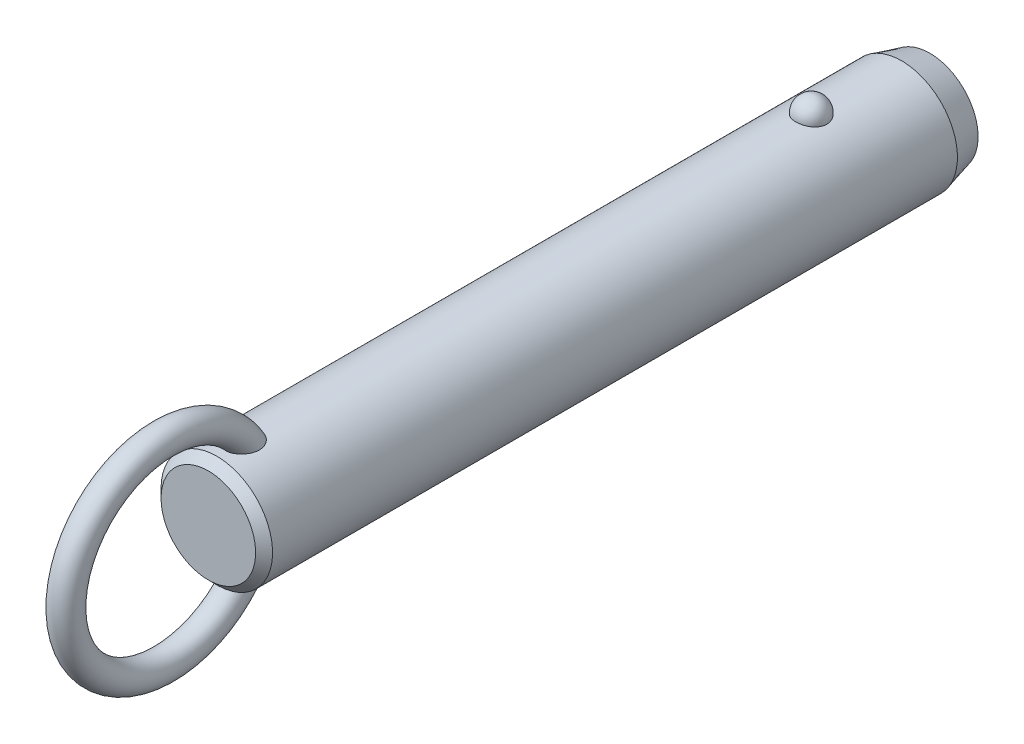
ISO-10303-21;
HEADER;
FILE_DESCRIPTION(('STEP AP214'),'2;1');
FILE_NAME('part.step','',(''),(''),'','','');
FILE_SCHEMA(('AUTOMOTIVE_DESIGN { 1 0 10303 214 1 1 1 1 }'));
ENDSEC;
DATA;
#1=APPLICATION_CONTEXT('core data for automotive mechanical design processes');
#2=APPLICATION_PROTOCOL_DEFINITION('international standard','automotive_design',2000,#1);
#3=PRODUCT_CONTEXT('',#1,'mechanical');
#4=PRODUCT('Part','Part','',(#3));
#5=PRODUCT_RELATED_PRODUCT_CATEGORY('part','',(#4));
#6=PRODUCT_DEFINITION_FORMATION('','',#4);
#7=PRODUCT_DEFINITION_CONTEXT('part definition',#1,'design');
#8=PRODUCT_DEFINITION('design','',#6,#7);
#9=PRODUCT_DEFINITION_SHAPE('','',#8);
#10=(LENGTH_UNIT() NAMED_UNIT(*) SI_UNIT(.MILLI.,.METRE.));
#11=(NAMED_UNIT(*) PLANE_ANGLE_UNIT() SI_UNIT($,.RADIAN.));
#12=(NAMED_UNIT(*) SI_UNIT($,.STERADIAN.) SOLID_ANGLE_UNIT());
#13=UNCERTAINTY_MEASURE_WITH_UNIT(LENGTH_MEASURE(1.E-05),#10,'distance_accuracy_value','');
#14=(GEOMETRIC_REPRESENTATION_CONTEXT(3) GLOBAL_UNCERTAINTY_ASSIGNED_CONTEXT((#13)) GLOBAL_UNIT_ASSIGNED_CONTEXT((#10,
#11,#12)) REPRESENTATION_CONTEXT('',''));
#15=CARTESIAN_POINT('',(0.,0.,0.));
#16=DIRECTION('',(0.,0.,1.));
#17=DIRECTION('',(1.,0.,0.));
#18=AXIS2_PLACEMENT_3D('',#15,#16,#17);
#19=CARTESIAN_POINT('',(0.,0.,73.7));
#20=DIRECTION('',(0.,0.,-1.));
#21=DIRECTION('',(-1.,0.,0.));
#22=AXIS2_PLACEMENT_3D('',#19,#20,#21);
#23=CYLINDRICAL_SURFACE('',#22,7.9);
#24=CARTESIAN_POINT('',(2.1785689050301,7.59367088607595,-2.19999999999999));
#25=CARTESIAN_POINT('',(2.17856679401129,7.59367269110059,-2.07701843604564));
#26=CARTESIAN_POINT('',(2.16853481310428,7.59657145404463,-1.95401006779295));
#27=CARTESIAN_POINT('',(2.12864689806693,7.607843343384,-1.71147811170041));
#28=CARTESIAN_POINT('',(2.09878338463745,7.61621856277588,-1.59195587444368));
#29=CARTESIAN_POINT('',(2.0199931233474,7.63749180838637,-1.3598563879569));
#30=CARTESIAN_POINT('',(1.97107475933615,7.6503878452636,-1.24727610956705));
#31=CARTESIAN_POINT('',(1.85539377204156,7.67926115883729,-1.03213234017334));
#32=CARTESIAN_POINT('',(1.78863158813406,7.69523835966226,-0.929568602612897));
#33=CARTESIAN_POINT('',(1.63856494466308,7.7285848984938,-0.736786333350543));
#34=CARTESIAN_POINT('',(1.55518140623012,7.7459606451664,-0.646630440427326));
#35=CARTESIAN_POINT('',(1.37422937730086,7.78009978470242,-0.481747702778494));
#36=CARTESIAN_POINT('',(1.27666086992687,7.79686317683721,-0.407020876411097));
#37=CARTESIAN_POINT('',(1.07024728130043,7.82786153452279,-0.275278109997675));
#38=CARTESIAN_POINT('',(0.961434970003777,7.84210353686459,-0.218212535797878));
#39=CARTESIAN_POINT('',(0.735351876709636,7.86652194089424,-0.123146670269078));
#40=CARTESIAN_POINT('',(0.618082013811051,7.87669878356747,-0.085144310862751));
#41=CARTESIAN_POINT('',(0.380637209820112,7.89170521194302,-0.0298158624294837));
#42=CARTESIAN_POINT('',(0.260550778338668,7.89662650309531,-0.0121347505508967));
#43=CARTESIAN_POINT('',(0.0190117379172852,7.90090003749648,0.00324379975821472));
#44=CARTESIAN_POINT('',(-0.102440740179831,7.90025280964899,0.00094313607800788));
#45=CARTESIAN_POINT('',(-0.341452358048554,7.89351056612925,-0.0233955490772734));
#46=CARTESIAN_POINT('',(-0.459042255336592,7.88749257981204,-0.0451545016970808));
#47=CARTESIAN_POINT('',(-0.688796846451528,7.87075812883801,-0.107408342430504));
#48=CARTESIAN_POINT('',(-0.800961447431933,7.86004158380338,-0.147903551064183));
#49=CARTESIAN_POINT('',(-1.01743634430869,7.83497131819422,-0.246799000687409));
#50=CARTESIAN_POINT('',(-1.12169791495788,7.82059709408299,-0.305300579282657));
#51=CARTESIAN_POINT('',(-1.31891765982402,7.78976470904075,-0.438549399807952));
#52=CARTESIAN_POINT('',(-1.41187469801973,7.77330633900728,-0.513298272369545));
#53=CARTESIAN_POINT('',(-1.58577142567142,7.73972434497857,-0.678622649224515));
#54=CARTESIAN_POINT('',(-1.66645140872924,7.72259402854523,-0.769470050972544));
#55=CARTESIAN_POINT('',(-1.81161503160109,7.68983776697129,-0.963538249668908));
#56=CARTESIAN_POINT('',(-1.87609753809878,7.6742119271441,-1.06675991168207));
#57=CARTESIAN_POINT('',(-1.98790138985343,7.6460202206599,-1.28401170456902));
#58=CARTESIAN_POINT('',(-2.03501994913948,7.63349104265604,-1.39815107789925));
#59=CARTESIAN_POINT('',(-2.10986724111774,7.6131449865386,-1.63301784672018));
#60=CARTESIAN_POINT('',(-2.1375965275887,7.60532797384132,-1.75374505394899));
#61=CARTESIAN_POINT('',(-2.17289256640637,7.5953195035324,-1.99782562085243));
#62=CARTESIAN_POINT('',(-2.18054294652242,7.59310471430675,-2.12116592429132));
#63=CARTESIAN_POINT('',(-2.17572919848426,7.59448538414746,-2.36741799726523));
#64=CARTESIAN_POINT('',(-2.1632656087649,7.59808068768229,-2.49032977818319));
#65=CARTESIAN_POINT('',(-2.11865035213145,7.61064035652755,-2.73161015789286));
#66=CARTESIAN_POINT('',(-2.08659579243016,7.61957823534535,-2.84999812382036));
#67=CARTESIAN_POINT('',(-2.00367799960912,7.64179982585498,-3.07955956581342));
#68=CARTESIAN_POINT('',(-1.9528140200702,7.65508371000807,-3.19073275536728));
#69=CARTESIAN_POINT('',(-1.83321113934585,7.68460381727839,-3.40337899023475));
#70=CARTESIAN_POINT('',(-1.76437735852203,7.70085556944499,-3.50479651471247));
#71=CARTESIAN_POINT('',(-1.61069526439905,7.73445734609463,-3.69446912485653));
#72=CARTESIAN_POINT('',(-1.52584634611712,7.75180741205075,-3.78272371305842));
#73=CARTESIAN_POINT('',(-1.34198059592,7.78574608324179,-3.94393987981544));
#74=CARTESIAN_POINT('',(-1.24291308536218,7.80233167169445,-4.01684434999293));
#75=CARTESIAN_POINT('',(-1.03352039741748,7.83281625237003,-4.14489386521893));
#76=CARTESIAN_POINT('',(-0.92319600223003,7.84671543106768,-4.20004014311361));
#77=CARTESIAN_POINT('',(-0.695822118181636,7.87011575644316,-4.29042017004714));
#78=CARTESIAN_POINT('',(-0.578872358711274,7.87966903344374,-4.32589112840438));
#79=CARTESIAN_POINT('',(-0.340410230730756,7.8935652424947,-4.37692226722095));
#80=CARTESIAN_POINT('',(-0.218898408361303,7.89790879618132,-4.39248482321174));
#81=CARTESIAN_POINT('',(0.0228107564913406,7.90087453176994,-4.40314405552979));
#82=CARTESIAN_POINT('',(0.142990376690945,7.89960185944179,-4.39861683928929));
#83=CARTESIAN_POINT('',(0.380829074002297,7.89171262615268,-4.37008293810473));
#84=CARTESIAN_POINT('',(0.498488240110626,7.8850962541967,-4.34607694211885));
#85=CARTESIAN_POINT('',(0.727535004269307,7.86726442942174,-4.27939317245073));
#86=CARTESIAN_POINT('',(0.838944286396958,7.85606616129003,-4.236785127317));
#87=CARTESIAN_POINT('',(1.05295421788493,7.83025654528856,-4.13408348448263));
#88=CARTESIAN_POINT('',(1.15555431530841,7.81564498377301,-4.07398879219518));
#89=CARTESIAN_POINT('',(1.35076763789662,7.7843022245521,-3.93687432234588));
#90=CARTESIAN_POINT('',(1.4432046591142,7.76754209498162,-3.85961036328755));
#91=CARTESIAN_POINT('',(1.6139111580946,7.73387857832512,-3.69076949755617));
#92=CARTESIAN_POINT('',(1.6921781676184,7.71697516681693,-3.59919010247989));
#93=CARTESIAN_POINT('',(1.83380875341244,7.6845643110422,-3.40247278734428));
#94=CARTESIAN_POINT('',(1.89689280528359,7.66908588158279,-3.29712873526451));
#95=CARTESIAN_POINT('',(2.0047823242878,7.64159441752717,-3.07707931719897));
#96=CARTESIAN_POINT('',(2.0495945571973,7.62958010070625,-2.96237743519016));
#97=CARTESIAN_POINT('',(2.11580183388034,7.61146617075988,-2.74040519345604));
#98=CARTESIAN_POINT('',(2.13929812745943,7.60484503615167,-2.63379846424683));
#99=CARTESIAN_POINT('',(2.17068242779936,7.59594664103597,-2.41813481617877));
#100=CARTESIAN_POINT('',(2.17857077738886,7.59366928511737,-2.30907795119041));
#101=CARTESIAN_POINT('',(2.1785689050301,7.59367088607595,-2.19999999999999));
#102=B_SPLINE_CURVE_WITH_KNOTS('',3,(#24,#25,#26,#27,#28,#29,#30,#31,#32,#33,#34,#35,#36,#37,
#38,#39,#40,#41,#42,#43,#44,#45,#46,#47,#48,#49,#50,#51,#52,#53,#54,#55,#56,#57,#58,#59,#60,#61,
#62,#63,#64,#65,#66,#67,#68,#69,#70,#71,#72,#73,#74,#75,#76,#77,#78,#79,#80,#81,#82,#83,#84,#85,
#86,#87,#88,#89,#90,#91,#92,#93,#94,#95,#96,#97,#98,#99,#100,#101),.UNSPECIFIED.,.T.,.F.,(4,2,2,
2,2,2,2,2,2,2,2,2,2,2,2,2,2,2,2,2,2,2,2,2,2,2,2,2,2,2,2,2,2,2,2,2,2,2,4),(0.,0.368552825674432,
0.737246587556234,1.10577831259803,1.4743009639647,1.8446206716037,2.21494081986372,
2.5842105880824,2.95344028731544,3.31611630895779,3.67875788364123,4.03628044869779,
4.39380913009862,4.75338791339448,5.11300280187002,5.47939989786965,5.8458226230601,
6.21639834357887,6.58696347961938,6.95598276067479,7.32499216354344,7.69218715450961,
8.0593967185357,8.42858578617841,8.79778880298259,9.16834203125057,9.5388695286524,
9.90482699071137,10.2707407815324,10.6298333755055,10.9889132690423,11.3466585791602,
11.7044262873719,12.0676511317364,12.4309391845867,12.8004764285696,13.1698767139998,
13.4967701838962,13.8236564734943),.UNSPECIFIED.);
#103=CARTESIAN_POINT('',(2.1785689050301,7.59367088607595,-2.19999999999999));
#104=VERTEX_POINT('',#103);
#105=EDGE_CURVE('E41',#104,#104,#102,.T.);
#106=ORIENTED_EDGE('',*,*,#105,.T.);
#107=EDGE_LOOP('',(#106));
#108=FACE_BOUND('',#107,.T.);
#109=CARTESIAN_POINT('',(0.,0.,82.02));
#110=DIRECTION('',(0.,0.,1.));
#111=DIRECTION('',(1.,0.,0.));
#112=AXIS2_PLACEMENT_3D('',#109,#110,#111);
#113=CIRCLE('',#112,7.9);
#114=CARTESIAN_POINT('',(-7.90000000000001,0.,82.02));
#115=VERTEX_POINT('',#114);
#116=EDGE_CURVE('E10',#115,#115,#113,.F.);
#117=ORIENTED_EDGE('',*,*,#116,.T.);
#118=EDGE_LOOP('',(#117));
#119=FACE_BOUND('',#118,.T.);
#120=CARTESIAN_POINT('',(-0.630969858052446,-7.87476203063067,75.9124322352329));
#121=CARTESIAN_POINT('',(-0.734180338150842,-7.8664899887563,75.947285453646));
#122=CARTESIAN_POINT('',(-0.834476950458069,-7.85639291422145,75.9908160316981));
#123=CARTESIAN_POINT('',(-1.0262035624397,-7.83366343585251,76.0940948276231));
#124=CARTESIAN_POINT('',(-1.1176141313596,-7.82102565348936,76.1538775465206));
#125=CARTESIAN_POINT('',(-1.28877277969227,-7.79464922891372,76.2878390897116));
#126=CARTESIAN_POINT('',(-1.36854014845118,-7.78091246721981,76.361993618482));
#127=CARTESIAN_POINT('',(-1.5146152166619,-7.75380398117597,76.5224941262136));
#128=CARTESIAN_POINT('',(-1.58092966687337,-7.74043207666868,76.6088339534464));
#129=CARTESIAN_POINT('',(-1.70019064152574,-7.71512522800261,76.7929784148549));
#130=CARTESIAN_POINT('',(-1.75284037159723,-7.70322473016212,76.8909792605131));
#131=CARTESIAN_POINT('',(-1.84263464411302,-7.68224112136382,77.0941029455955));
#132=CARTESIAN_POINT('',(-1.87977299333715,-7.6731591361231,77.1992286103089));
#133=CARTESIAN_POINT('',(-1.94152728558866,-7.65777930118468,77.4232849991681));
#134=CARTESIAN_POINT('',(-1.96475471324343,-7.65179654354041,77.5426167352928));
#135=CARTESIAN_POINT('',(-1.99449499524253,-7.64409642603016,77.7834298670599));
#136=CARTESIAN_POINT('',(-2.0010005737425,-7.64238092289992,77.9049121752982));
#137=CARTESIAN_POINT('',(-1.99856014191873,-7.64302120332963,78.1683409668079));
#138=CARTESIAN_POINT('',(-1.98680021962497,-7.64611845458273,78.3102565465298));
#139=CARTESIAN_POINT('',(-1.94457772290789,-7.65696186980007,78.5911188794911));
#140=CARTESIAN_POINT('',(-1.91409393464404,-7.66471330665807,78.7300620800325));
#141=CARTESIAN_POINT('',(-1.82768670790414,-7.68582947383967,79.0319397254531));
#142=CARTESIAN_POINT('',(-1.76772963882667,-7.70003779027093,79.193686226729));
#143=CARTESIAN_POINT('',(-1.65998501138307,-7.72371550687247,79.4276956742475));
#144=CARTESIAN_POINT('',(-1.621079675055,-7.73200670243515,79.5042974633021));
#145=CARTESIAN_POINT('',(-1.53727726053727,-7.74910377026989,79.6540798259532));
#146=CARTESIAN_POINT('',(-1.49238215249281,-7.75790947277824,79.7272615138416));
#147=CARTESIAN_POINT('',(-1.3739705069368,-7.77993338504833,79.9028838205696));
#148=CARTESIAN_POINT('',(-1.29690364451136,-7.79328473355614,80.0029557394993));
#149=CARTESIAN_POINT('',(-1.12885487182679,-7.81939266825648,80.1907147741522));
#150=CARTESIAN_POINT('',(-1.03789926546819,-7.83215032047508,80.2784247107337));
#151=CARTESIAN_POINT('',(-0.869532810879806,-7.85231710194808,80.4134148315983));
#152=CARTESIAN_POINT('',(-0.795716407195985,-7.86021093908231,80.465076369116));
#153=CARTESIAN_POINT('',(-0.64081313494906,-7.87434920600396,80.5563815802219));
#154=CARTESIAN_POINT('',(-0.55973779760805,-7.88059619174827,80.5960438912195));
#155=CARTESIAN_POINT('',(-0.406456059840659,-7.88984116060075,80.6543008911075));
#156=CARTESIAN_POINT('',(-0.335227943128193,-7.89321892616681,80.6753848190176));
#157=CARTESIAN_POINT('',(-0.190193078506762,-7.89804235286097,80.7054141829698));
#158=CARTESIAN_POINT('',(-0.116388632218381,-7.89948969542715,80.7143701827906));
#159=CARTESIAN_POINT('',(0.0318414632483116,-7.90028409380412,80.7192915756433));
#160=CARTESIAN_POINT('',(0.10626813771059,-7.89962640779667,80.7152276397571));
#161=CARTESIAN_POINT('',(0.253290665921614,-7.8962818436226,80.6944615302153));
#162=CARTESIAN_POINT('',(0.32588518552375,-7.8935935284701,80.6777504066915));
#163=CARTESIAN_POINT('',(0.481441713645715,-7.88577340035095,80.6287380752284));
#164=CARTESIAN_POINT('',(0.563611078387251,-7.88026321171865,80.594005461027));
#165=CARTESIAN_POINT('',(0.721129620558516,-7.86741729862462,80.5117965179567));
#166=CARTESIAN_POINT('',(0.796466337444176,-7.86007832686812,80.4642975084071));
#167=CARTESIAN_POINT('',(0.971456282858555,-7.84073285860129,80.336513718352));
#168=CARTESIAN_POINT('',(1.06719686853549,-7.82809461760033,80.2510047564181));
#169=CARTESIAN_POINT('',(1.24418921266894,-7.80192439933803,80.066232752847));
#170=CARTESIAN_POINT('',(1.32540832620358,-7.78839049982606,79.9669395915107));
#171=CARTESIAN_POINT('',(1.45199971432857,-7.76559693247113,79.7895760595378));
#172=CARTESIAN_POINT('',(1.5008564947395,-7.75626094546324,79.7139542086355));
#173=CARTESIAN_POINT('',(1.59197749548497,-7.7380727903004,79.5587428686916));
#174=CARTESIAN_POINT('',(1.63423919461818,-7.72922080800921,79.4791518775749));
#175=CARTESIAN_POINT('',(1.71222612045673,-7.71231959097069,79.3166640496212));
#176=CARTESIAN_POINT('',(1.7479451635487,-7.70427111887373,79.2337641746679));
#177=CARTESIAN_POINT('',(1.81270113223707,-7.68929240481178,79.0652967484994));
#178=CARTESIAN_POINT('',(1.84173789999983,-7.68236218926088,78.9797291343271));
#179=CARTESIAN_POINT('',(1.89322698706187,-7.66983757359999,78.8052870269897));
#180=CARTESIAN_POINT('',(1.91558744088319,-7.66426199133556,78.7163838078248));
#181=CARTESIAN_POINT('',(1.95281367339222,-7.65485915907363,78.5369696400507));
#182=CARTESIAN_POINT('',(1.96767946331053,-7.65103190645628,78.4464586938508));
#183=CARTESIAN_POINT('',(2.00021456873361,-7.64262981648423,78.1737320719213));
#184=CARTESIAN_POINT('',(2.00600691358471,-7.6410871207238,77.9897099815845));
#185=CARTESIAN_POINT('',(1.98445334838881,-7.64669564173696,77.6765019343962));
#186=CARTESIAN_POINT('',(1.96607186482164,-7.65149688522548,77.5466189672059));
#187=CARTESIAN_POINT('',(1.90884967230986,-7.6659762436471,77.2916321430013));
#188=CARTESIAN_POINT('',(1.8700210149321,-7.67565148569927,77.166525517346));
#189=CARTESIAN_POINT('',(1.77063986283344,-7.69918471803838,76.9245401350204));
#190=CARTESIAN_POINT('',(1.70993724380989,-7.71307150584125,76.8077250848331));
#191=CARTESIAN_POINT('',(1.56733070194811,-7.74330306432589,76.5881444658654));
#192=CARTESIAN_POINT('',(1.4854369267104,-7.75964665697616,76.4853722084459));
#193=CARTESIAN_POINT('',(1.31346177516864,-7.79047523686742,76.3093800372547));
#194=CARTESIAN_POINT('',(1.22547278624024,-7.80495298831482,76.2341066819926));
#195=CARTESIAN_POINT('',(1.03724352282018,-7.83218597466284,76.1004864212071));
#196=CARTESIAN_POINT('',(0.937008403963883,-7.84494192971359,76.0421324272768));
#197=CARTESIAN_POINT('',(0.733599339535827,-7.86649045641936,75.9470270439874));
#198=CARTESIAN_POINT('',(0.630941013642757,-7.87547134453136,75.9092109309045));
#199=CARTESIAN_POINT('',(0.420465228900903,-7.88950708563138,75.8511160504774));
#200=CARTESIAN_POINT('',(0.312645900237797,-7.89456050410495,75.8308436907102));
#201=CARTESIAN_POINT('',(0.0960869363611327,-7.9001518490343,75.8084559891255));
#202=CARTESIAN_POINT('',(-0.0126341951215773,-7.90073226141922,75.8061698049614));
#203=CARTESIAN_POINT('',(-0.228766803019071,-7.89742350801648,75.8193678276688));
#204=CARTESIAN_POINT('',(-0.336180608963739,-7.89354403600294,75.8348134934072));
#205=CARTESIAN_POINT('',(-0.473410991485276,-7.88586871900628,75.8662177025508));
#206=CARTESIAN_POINT('',(-0.50525779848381,-7.88388984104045,75.8743541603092));
#207=CARTESIAN_POINT('',(-0.5684812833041,-7.87958326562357,75.8922083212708));
#208=CARTESIAN_POINT('',(-0.599857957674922,-7.87725556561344,75.9019260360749));
#209=CARTESIAN_POINT('',(-0.630969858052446,-7.87476203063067,75.9124322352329));
#210=B_SPLINE_CURVE_WITH_KNOTS('',3,(#120,#121,#122,#123,#124,#125,#126,#127,#128,#129,#130,
#131,#132,#133,#134,#135,#136,#137,#138,#139,#140,#141,#142,#143,#144,#145,#146,#147,#148,#149,
#150,#151,#152,#153,#154,#155,#156,#157,#158,#159,#160,#161,#162,#163,#164,#165,#166,#167,#168,
#169,#170,#171,#172,#173,#174,#175,#176,#177,#178,#179,#180,#181,#182,#183,#184,#185,#186,#187,
#188,#189,#190,#191,#192,#193,#194,#195,#196,#197,#198,#199,#200,#201,#202,#203,#204,#205,#206,
#207,#208,#209),.UNSPECIFIED.,.T.,.F.,(4,2,2,2,2,2,2,2,2,2,2,2,2,2,2,2,2,2,2,2,2,2,2,2,2,2,2,2,
2,2,2,2,2,2,2,2,2,2,2,2,2,2,2,2,4),(0.,0.327622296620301,0.655945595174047,0.983718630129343,
1.3113267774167,1.64554655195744,1.9798996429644,2.34365728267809,2.70757317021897,
3.13333684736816,3.55958380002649,4.07655306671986,4.33527897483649,4.59391999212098,
4.9738243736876,5.35301797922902,5.62348245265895,5.89352465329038,6.11565959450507,
6.33760092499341,6.56004255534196,6.78264174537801,7.04930844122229,7.31645206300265,
7.70130871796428,8.08701995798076,8.35824509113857,8.62957365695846,8.90115735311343,
9.17274746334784,9.44791855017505,9.72308922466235,10.2715298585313,10.6638393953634,
11.0559179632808,11.4507403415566,11.845374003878,12.1936425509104,12.5417649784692,
12.8695063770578,13.1973674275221,13.5221104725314,13.8461490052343,13.9449071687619,
14.0436660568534),.UNSPECIFIED.);
#211=CARTESIAN_POINT('',(-0.630969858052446,-7.87476203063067,75.9124322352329));
#212=VERTEX_POINT('',#211);
#213=EDGE_CURVE('E60',#212,#212,#210,.T.);
#214=ORIENTED_EDGE('',*,*,#213,.T.);
#215=EDGE_LOOP('',(#214));
#216=FACE_BOUND('',#215,.T.);
#217=CARTESIAN_POINT('',(-0.630969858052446,7.87476203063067,75.9124322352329));
#218=CARTESIAN_POINT('',(-0.52891882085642,7.88293636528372,75.8779798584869));
#219=CARTESIAN_POINT('',(-0.423745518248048,7.8893481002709,75.851915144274));
#220=CARTESIAN_POINT('',(-0.210236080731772,7.8979273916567,75.8172825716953));
#221=CARTESIAN_POINT('',(-0.10189380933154,7.90008607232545,75.8087513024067));
#222=CARTESIAN_POINT('',(0.114660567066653,7.89990877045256,75.8094570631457));
#223=CARTESIAN_POINT('',(0.222872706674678,7.89757640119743,75.8186798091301));
#224=CARTESIAN_POINT('',(0.436107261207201,7.88867538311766,75.8546525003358));
#225=CARTESIAN_POINT('',(0.541131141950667,7.8821087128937,75.8813942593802));
#226=CARTESIAN_POINT('',(0.745085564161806,7.86545130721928,75.9517561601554));
#227=CARTESIAN_POINT('',(0.844015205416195,7.85536005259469,75.9953787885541));
#228=CARTESIAN_POINT('',(1.03299167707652,7.83275153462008,76.0983796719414));
#229=CARTESIAN_POINT('',(1.12303841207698,7.8202342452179,76.1577580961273));
#230=CARTESIAN_POINT('',(1.29214734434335,7.79408219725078,76.2908647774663));
#231=CARTESIAN_POINT('',(1.37116907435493,7.78044359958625,76.3646436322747));
#232=CARTESIAN_POINT('',(1.51597677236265,7.75353170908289,76.5242353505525));
#233=CARTESIAN_POINT('',(1.58176261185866,7.74025841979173,76.6100483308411));
#234=CARTESIAN_POINT('',(1.70057386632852,7.71504069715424,76.793644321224));
#235=CARTESIAN_POINT('',(1.75320073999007,7.7031425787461,76.8916906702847));
#236=CARTESIAN_POINT('',(1.8429376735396,7.68216822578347,77.0948931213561));
#237=CARTESIAN_POINT('',(1.88004278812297,7.67309289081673,77.2000514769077));
#238=CARTESIAN_POINT('',(1.9417232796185,7.6577294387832,77.4241671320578));
#239=CARTESIAN_POINT('',(1.96491037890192,7.65175648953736,77.5435248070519));
#240=CARTESIAN_POINT('',(1.9945689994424,7.64407702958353,77.7843848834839));
#241=CARTESIAN_POINT('',(2.00103304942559,7.64237242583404,77.9058882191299));
#242=CARTESIAN_POINT('',(1.9985016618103,7.64303650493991,78.1693688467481));
#243=CARTESIAN_POINT('',(1.98669038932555,7.64614714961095,78.3113141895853));
#244=CARTESIAN_POINT('',(1.94436120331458,7.6570170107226,78.5922287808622));
#245=CARTESIAN_POINT('',(1.91382203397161,7.66478150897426,78.7311944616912));
#246=CARTESIAN_POINT('',(1.82728754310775,7.68592483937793,79.0331110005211));
#247=CARTESIAN_POINT('',(1.76725778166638,7.70014685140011,79.194872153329));
#248=CARTESIAN_POINT('',(1.65939700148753,7.72384204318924,79.4288914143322));
#249=CARTESIAN_POINT('',(1.62045187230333,7.73213852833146,79.5054942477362));
#250=CARTESIAN_POINT('',(1.5365668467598,7.74924489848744,79.6552737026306));
#251=CARTESIAN_POINT('',(1.49162892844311,7.75805461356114,79.7284514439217));
#252=CARTESIAN_POINT('',(1.37317698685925,7.78007342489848,79.9039520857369));
#253=CARTESIAN_POINT('',(1.29612360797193,7.79341423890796,80.0039112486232));
#254=CARTESIAN_POINT('',(1.12812043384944,7.81949839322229,80.1914508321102));
#255=CARTESIAN_POINT('',(1.03719688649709,7.83224280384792,80.2790540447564));
#256=CARTESIAN_POINT('',(0.868871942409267,7.85239026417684,80.4138971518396));
#257=CARTESIAN_POINT('',(0.795056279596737,7.86027769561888,80.4655113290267));
#258=CARTESIAN_POINT('',(0.640160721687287,7.87440222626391,80.5567201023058));
#259=CARTESIAN_POINT('',(0.559092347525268,7.88064188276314,80.5963333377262));
#260=CARTESIAN_POINT('',(0.405820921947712,7.8898738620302,80.6545056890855));
#261=CARTESIAN_POINT('',(0.33459413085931,7.89324577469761,80.6755523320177));
#262=CARTESIAN_POINT('',(0.189568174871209,7.89805733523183,80.7055070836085));
#263=CARTESIAN_POINT('',(0.115771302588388,7.89949866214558,80.7144257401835));
#264=CARTESIAN_POINT('',(-0.0324359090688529,7.90028156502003,80.7192758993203));
#265=CARTESIAN_POINT('',(-0.106847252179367,7.89961843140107,80.7151782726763));
#266=CARTESIAN_POINT('',(-0.253834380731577,7.8962642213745,80.6943519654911));
#267=CARTESIAN_POINT('',(-0.326408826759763,7.89357170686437,80.6776143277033));
#268=CARTESIAN_POINT('',(-0.481962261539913,7.88574179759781,80.6285391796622));
#269=CARTESIAN_POINT('',(-0.564145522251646,7.88022507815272,80.5937638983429));
#270=CARTESIAN_POINT('',(-0.721685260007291,7.86736646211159,80.5114686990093));
#271=CARTESIAN_POINT('',(-0.797029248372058,7.8600213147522,80.4639260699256));
#272=CARTESIAN_POINT('',(-0.97204426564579,7.84066026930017,80.3360267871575));
#273=CARTESIAN_POINT('',(-1.06779803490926,7.82801274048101,80.2504436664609));
#274=CARTESIAN_POINT('',(-1.24480531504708,7.80182621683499,80.0655223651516));
#275=CARTESIAN_POINT('',(-1.32602618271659,7.78828530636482,79.9661540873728));
#276=CARTESIAN_POINT('',(-1.45259834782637,7.76548487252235,79.7886806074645));
#277=CARTESIAN_POINT('',(-1.50143856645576,7.75614818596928,79.7130252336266));
#278=CARTESIAN_POINT('',(-1.59252410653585,7.73796020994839,79.5577484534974));
#279=CARTESIAN_POINT('',(-1.63476690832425,7.72910910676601,79.4781255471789));
#280=CARTESIAN_POINT('',(-1.71271318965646,7.71221133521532,79.3155750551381));
#281=CARTESIAN_POINT('',(-1.74841047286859,7.70416543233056,79.2326444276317));
#282=CARTESIAN_POINT('',(-1.81311929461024,7.6891937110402,79.0641168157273));
#283=CARTESIAN_POINT('',(-1.84213067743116,7.6822679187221,78.9785197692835));
#284=CARTESIAN_POINT('',(-1.89356259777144,7.66975461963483,78.8040254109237));
#285=CARTESIAN_POINT('',(-1.91589165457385,7.66418586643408,78.7150995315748));
#286=CARTESIAN_POINT('',(-1.95305070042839,7.65479859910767,78.5356424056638));
#287=CARTESIAN_POINT('',(-1.96788069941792,7.65098008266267,78.4451111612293));
#288=CARTESIAN_POINT('',(-2.00030078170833,7.64260704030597,78.1723270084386));
#289=CARTESIAN_POINT('',(-2.00600576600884,7.64108760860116,77.9882718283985));
#290=CARTESIAN_POINT('',(-1.98428483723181,7.64673945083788,77.6750800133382));
#291=CARTESIAN_POINT('',(-1.96583698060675,7.6515575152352,77.5452400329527));
#292=CARTESIAN_POINT('',(-1.90848948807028,7.66606613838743,77.2903619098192));
#293=CARTESIAN_POINT('',(-1.86960376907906,7.67575338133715,77.165320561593));
#294=CARTESIAN_POINT('',(-1.7701342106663,7.6993013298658,76.9235009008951));
#295=CARTESIAN_POINT('',(-1.70940488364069,7.71318991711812,76.8067844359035));
#296=CARTESIAN_POINT('',(-1.56672953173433,7.74342495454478,76.5873404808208));
#297=CARTESIAN_POINT('',(-1.48478316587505,7.75977144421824,76.4846132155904));
#298=CARTESIAN_POINT('',(-1.31266325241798,7.79061163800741,76.3086431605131));
#299=CARTESIAN_POINT('',(-1.22456383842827,7.80509908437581,76.2333589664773));
#300=CARTESIAN_POINT('',(-1.03622400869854,7.83231881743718,76.0998659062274));
#301=CARTESIAN_POINT('',(-0.936015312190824,7.84505551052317,76.0416137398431));
#302=CARTESIAN_POINT('',(-0.798824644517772,7.85957802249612,75.9775408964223));
#303=CARTESIAN_POINT('',(-0.765787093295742,7.86286821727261,75.9632248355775));
#304=CARTESIAN_POINT('',(-0.698939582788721,7.86909211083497,75.936436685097));
#305=CARTESIAN_POINT('',(-0.665129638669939,7.8720258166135,75.9239645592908));
#306=CARTESIAN_POINT('',(-0.630969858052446,7.87476203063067,75.9124322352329));
#307=B_SPLINE_CURVE_WITH_KNOTS('',3,(#217,#218,#219,#220,#221,#222,#223,#224,#225,#226,#227,
#228,#229,#230,#231,#232,#233,#234,#235,#236,#237,#238,#239,#240,#241,#242,#243,#244,#245,#246,
#247,#248,#249,#250,#251,#252,#253,#254,#255,#256,#257,#258,#259,#260,#261,#262,#263,#264,#265,
#266,#267,#268,#269,#270,#271,#272,#273,#274,#275,#276,#277,#278,#279,#280,#281,#282,#283,#284,
#285,#286,#287,#288,#289,#290,#291,#292,#293,#294,#295,#296,#297,#298,#299,#300,#301,#302,#303,
#304,#305,#306),.UNSPECIFIED.,.T.,.F.,(4,2,2,2,2,2,2,2,2,2,2,2,2,2,2,2,2,2,2,2,2,2,2,2,2,2,2,2,
2,2,2,2,2,2,2,2,2,2,2,2,2,2,2,2,4),(0.,0.323920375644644,0.648516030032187,0.97285063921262,
1.29703380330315,1.62126473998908,1.94549915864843,2.27089401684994,2.5962920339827,
2.93059633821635,3.26500707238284,3.62881644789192,3.99278833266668,4.41865421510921,
4.84500434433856,5.36209210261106,5.62087589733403,5.87957448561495,6.25918598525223,
6.63808782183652,6.90846748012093,7.17842501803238,7.40052350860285,7.62242871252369,
7.84483086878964,8.06739077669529,8.33414615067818,8.60137921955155,8.98641454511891,
9.3723041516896,9.6435867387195,9.91497268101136,10.1866142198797,10.4582620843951,
10.7334745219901,11.0086865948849,11.5572126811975,11.9494246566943,12.3413699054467,
12.7359755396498,13.1305875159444,13.4791770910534,13.82687259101,13.9353013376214,
14.0437279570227),.UNSPECIFIED.);
#308=CARTESIAN_POINT('',(-0.630969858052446,7.87476203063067,75.9124322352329));
#309=VERTEX_POINT('',#308);
#310=EDGE_CURVE('E68',#309,#309,#307,.T.);
#311=ORIENTED_EDGE('',*,*,#310,.T.);
#312=EDGE_LOOP('',(#311));
#313=FACE_BOUND('',#312,.T.);
#314=CARTESIAN_POINT('',(0.,0.,-14.9999999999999));
#315=DIRECTION('',(0.,0.,-1.));
#316=DIRECTION('',(-1.,0.,0.));
#317=AXIS2_PLACEMENT_3D('',#314,#315,#316);
#318=CIRCLE('',#317,7.9);
#319=CARTESIAN_POINT('',(-7.9,0.,-14.9999999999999));
#320=VERTEX_POINT('',#319);
#321=EDGE_CURVE('E57',#320,#320,#318,.F.);
#322=ORIENTED_EDGE('',*,*,#321,.T.);
#323=EDGE_LOOP('',(#322));
#324=FACE_BOUND('',#323,.T.);
#325=ADVANCED_FACE('F37',(#108,#119,#216,#313,#324),#23,.T.);
#326=CARTESIAN_POINT('',(0.,0.,-19.));
#327=DIRECTION('',(0.,0.,-1.));
#328=DIRECTION('',(-1.,0.,0.));
#329=AXIS2_PLACEMENT_3D('',#326,#327,#328);
#330=PLANE('',#329);
#331=CARTESIAN_POINT('',(0.,0.,-19.));
#332=DIRECTION('',(0.,0.,-1.));
#333=DIRECTION('',(-1.,0.,0.));
#334=AXIS2_PLACEMENT_3D('',#331,#332,#333);
#335=CIRCLE('',#334,6.82820323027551);
#336=CARTESIAN_POINT('',(-6.82820323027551,0.,-19.));
#337=VERTEX_POINT('',#336);
#338=EDGE_CURVE('E67',#337,#337,#335,.T.);
#339=ORIENTED_EDGE('',*,*,#338,.T.);
#340=EDGE_LOOP('',(#339));
#341=FACE_BOUND('',#340,.T.);
#342=ADVANCED_FACE('F86',(#341),#330,.T.);
#343=CARTESIAN_POINT('',(0.,0.,-19.));
#344=DIRECTION('',(0.,0.,1.));
#345=DIRECTION('',(1.,0.,0.));
#346=AXIS2_PLACEMENT_3D('',#343,#344,#345);
#347=CONICAL_SURFACE('',#346,6.82820323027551,0.261799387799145);
#348=ORIENTED_EDGE('',*,*,#321,.F.);
#349=EDGE_LOOP('',(#348));
#350=FACE_BOUND('',#349,.T.);
#351=ORIENTED_EDGE('',*,*,#338,.F.);
#352=EDGE_LOOP('',(#351));
#353=FACE_BOUND('',#352,.T.);
#354=ADVANCED_FACE('F84',(#350,#353),#347,.T.);
#355=CARTESIAN_POINT('',(0.,0.,83.22));
#356=DIRECTION('',(0.,0.,1.));
#357=DIRECTION('',(1.,0.,0.));
#358=AXIS2_PLACEMENT_3D('',#355,#356,#357);
#359=PLANE('',#358);
#360=CARTESIAN_POINT('',(0.,0.,83.22));
#361=DIRECTION('',(0.,0.,1.));
#362=DIRECTION('',(1.,0.,0.));
#363=AXIS2_PLACEMENT_3D('',#360,#361,#362);
#364=CIRCLE('',#363,6.69999999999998);
#365=CARTESIAN_POINT('',(-6.69999999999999,0.,83.22));
#366=VERTEX_POINT('',#365);
#367=EDGE_CURVE('E50',#366,#366,#364,.T.);
#368=ORIENTED_EDGE('',*,*,#367,.T.);
#369=EDGE_LOOP('',(#368));
#370=FACE_BOUND('',#369,.T.);
#371=ADVANCED_FACE('F78',(#370),#359,.T.);
#372=CARTESIAN_POINT('',(0.,0.,89.55));
#373=DIRECTION('',(1.,0.,0.));
#374=DIRECTION('',(0.,0.,-1.));
#375=AXIS2_PLACEMENT_3D('',#372,#373,#374);
#376=TOROIDAL_SURFACE('',#375,13.85,2.);
#377=ORIENTED_EDGE('',*,*,#310,.F.);
#378=EDGE_LOOP('',(#377));
#379=FACE_BOUND('',#378,.T.);
#380=ORIENTED_EDGE('',*,*,#213,.F.);
#381=EDGE_LOOP('',(#380));
#382=FACE_BOUND('',#381,.T.);
#383=ADVANCED_FACE('F74',(#379,#382),#376,.T.);
#384=CARTESIAN_POINT('',(0.,0.,83.22));
#385=DIRECTION('',(0.,0.,-1.));
#386=DIRECTION('',(-1.,0.,0.));
#387=AXIS2_PLACEMENT_3D('',#384,#385,#386);
#388=CONICAL_SURFACE('',#387,6.69999999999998,0.785398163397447);
#389=CARTESIAN_POINT('',(-7.90000000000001,0.,82.02));
#390=CARTESIAN_POINT('',(-7.88750000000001,0.,82.0325));
#391=CARTESIAN_POINT('',(-7.87500000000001,0.,82.045));
#392=CARTESIAN_POINT('',(-7.85000000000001,0.,82.07));
#393=CARTESIAN_POINT('',(-7.83750000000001,0.,82.0825));
#394=CARTESIAN_POINT('',(-7.81250000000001,0.,82.1075));
#395=CARTESIAN_POINT('',(-7.80000000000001,0.,82.12));
#396=CARTESIAN_POINT('',(-7.77500000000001,0.,82.145));
#397=CARTESIAN_POINT('',(-7.76250000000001,0.,82.1575));
#398=CARTESIAN_POINT('',(-7.73750000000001,0.,82.1825));
#399=CARTESIAN_POINT('',(-7.725,0.,82.195));
#400=CARTESIAN_POINT('',(-7.7,0.,82.22));
#401=CARTESIAN_POINT('',(-7.68750000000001,0.,82.2325));
#402=CARTESIAN_POINT('',(-7.66250000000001,0.,82.2575));
#403=CARTESIAN_POINT('',(-7.65000000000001,0.,82.27));
#404=CARTESIAN_POINT('',(-7.625,0.,82.295));
#405=CARTESIAN_POINT('',(-7.6125,0.,82.3075));
#406=CARTESIAN_POINT('',(-7.5875,0.,82.3325));
#407=CARTESIAN_POINT('',(-7.575,0.,82.345));
#408=CARTESIAN_POINT('',(-7.55,0.,82.37));
#409=CARTESIAN_POINT('',(-7.5375,0.,82.3825));
#410=CARTESIAN_POINT('',(-7.5125,0.,82.4075));
#411=CARTESIAN_POINT('',(-7.5,0.,82.42));
#412=CARTESIAN_POINT('',(-7.475,0.,82.445));
#413=CARTESIAN_POINT('',(-7.4625,0.,82.4575));
#414=CARTESIAN_POINT('',(-7.4375,0.,82.4825));
#415=CARTESIAN_POINT('',(-7.425,0.,82.495));
#416=CARTESIAN_POINT('',(-7.4,0.,82.52));
#417=CARTESIAN_POINT('',(-7.3875,0.,82.5325));
#418=CARTESIAN_POINT('',(-7.3625,0.,82.5575));
#419=CARTESIAN_POINT('',(-7.35,0.,82.57));
#420=CARTESIAN_POINT('',(-7.325,0.,82.595));
#421=CARTESIAN_POINT('',(-7.3125,0.,82.6075));
#422=CARTESIAN_POINT('',(-7.2875,0.,82.6325));
#423=CARTESIAN_POINT('',(-7.275,0.,82.645));
#424=CARTESIAN_POINT('',(-7.25,0.,82.67));
#425=CARTESIAN_POINT('',(-7.2375,0.,82.6825));
#426=CARTESIAN_POINT('',(-7.2125,0.,82.7075));
#427=CARTESIAN_POINT('',(-7.2,0.,82.72));
#428=CARTESIAN_POINT('',(-7.175,0.,82.745));
#429=CARTESIAN_POINT('',(-7.1625,0.,82.7575));
#430=CARTESIAN_POINT('',(-7.1375,0.,82.7825));
#431=CARTESIAN_POINT('',(-7.125,0.,82.795));
#432=CARTESIAN_POINT('',(-7.1,0.,82.82));
#433=CARTESIAN_POINT('',(-7.0875,0.,82.8325));
#434=CARTESIAN_POINT('',(-7.06249999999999,0.,82.8575));
#435=CARTESIAN_POINT('',(-7.04999999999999,0.,82.87));
#436=CARTESIAN_POINT('',(-7.02499999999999,0.,82.895));
#437=CARTESIAN_POINT('',(-7.0125,0.,82.9075));
#438=CARTESIAN_POINT('',(-6.9875,0.,82.9325));
#439=CARTESIAN_POINT('',(-6.975,0.,82.945));
#440=CARTESIAN_POINT('',(-6.94999999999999,0.,82.97));
#441=CARTESIAN_POINT('',(-6.93749999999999,0.,82.9825));
#442=CARTESIAN_POINT('',(-6.91249999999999,0.,83.0075));
#443=CARTESIAN_POINT('',(-6.9,0.,83.02));
#444=CARTESIAN_POINT('',(-6.87499999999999,0.,83.045));
#445=CARTESIAN_POINT('',(-6.86249999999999,0.,83.0575));
#446=CARTESIAN_POINT('',(-6.83749999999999,0.,83.0825));
#447=CARTESIAN_POINT('',(-6.82499999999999,0.,83.095));
#448=CARTESIAN_POINT('',(-6.79999999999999,0.,83.12));
#449=CARTESIAN_POINT('',(-6.78749999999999,0.,83.1325));
#450=CARTESIAN_POINT('',(-6.76249999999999,0.,83.1575));
#451=CARTESIAN_POINT('',(-6.74999999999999,0.,83.17));
#452=CARTESIAN_POINT('',(-6.72499999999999,0.,83.195));
#453=CARTESIAN_POINT('',(-6.71249999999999,0.,83.2075));
#454=CARTESIAN_POINT('',(-6.69999999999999,0.,83.22));
#455=B_SPLINE_CURVE_WITH_KNOTS('',3,(#389,#390,#391,#392,#393,#394,#395,#396,#397,#398,#399,
#400,#401,#402,#403,#404,#405,#406,#407,#408,#409,#410,#411,#412,#413,#414,#415,#416,#417,#418,
#419,#420,#421,#422,#423,#424,#425,#426,#427,#428,#429,#430,#431,#432,#433,#434,#435,#436,#437,
#438,#439,#440,#441,#442,#443,#444,#445,#446,#447,#448,#449,#450,#451,#452,#453,#454),
.UNSPECIFIED.,.F.,.F.,(4,2,2,2,2,2,2,2,2,2,2,2,2,2,2,2,2,2,2,2,2,2,2,2,2,2,2,2,2,2,2,2,4),(0.,
0.0530330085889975,0.106066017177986,0.159099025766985,0.212132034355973,0.265165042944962,
0.31819805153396,0.371231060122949,0.424264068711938,0.477297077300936,0.530330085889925,
0.583363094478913,0.636396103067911,0.6894291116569,0.742462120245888,0.795495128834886,
0.848528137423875,0.901561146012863,0.954594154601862,1.00762716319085,1.06066017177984,
1.11369318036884,1.16672618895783,1.21975919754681,1.27279220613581,1.3258252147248,
1.37885822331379,1.43189123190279,1.48492424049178,1.53795724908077,1.59099025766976,
1.64402326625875,1.69705627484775),.UNSPECIFIED.);
#456=EDGE_CURVE('BSEAM39',#115,#366,#455,.T.);
#457=ORIENTED_EDGE('',*,*,#116,.F.);
#458=ORIENTED_EDGE('',*,*,#367,.F.);
#459=ORIENTED_EDGE('',*,*,#456,.T.);
#460=ORIENTED_EDGE('',*,*,#456,.F.);
#461=EDGE_LOOP('',(#457,#459,#458,#460));
#462=FACE_BOUND('',#461,.T.);
#463=ADVANCED_FACE('F39',(#462),#388,.T.);
#464=CARTESIAN_POINT('',(0.,7.9,-2.19999999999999));
#465=DIRECTION('',(0.,1.,0.));
#466=DIRECTION('',(0.,0.,-1.));
#467=AXIS2_PLACEMENT_3D('',#464,#465,#466);
#468=SPHERICAL_SURFACE('',#467,2.2);
#469=ORIENTED_EDGE('',*,*,#105,.F.);
#470=EDGE_LOOP('',(#469));
#471=FACE_BOUND('',#470,.T.);
#472=ADVANCED_FACE('F80',(#471),#468,.T.);
#473=CLOSED_SHELL('',(#325,#342,#354,#371,#383,#463,#472));
#474=MANIFOLD_SOLID_BREP('B2',#473);
#475=ADVANCED_BREP_SHAPE_REPRESENTATION('',(#18,#474),#14);
#476=SHAPE_DEFINITION_REPRESENTATION(#9,#475);
ENDSEC;
END-ISO-10303-21;
